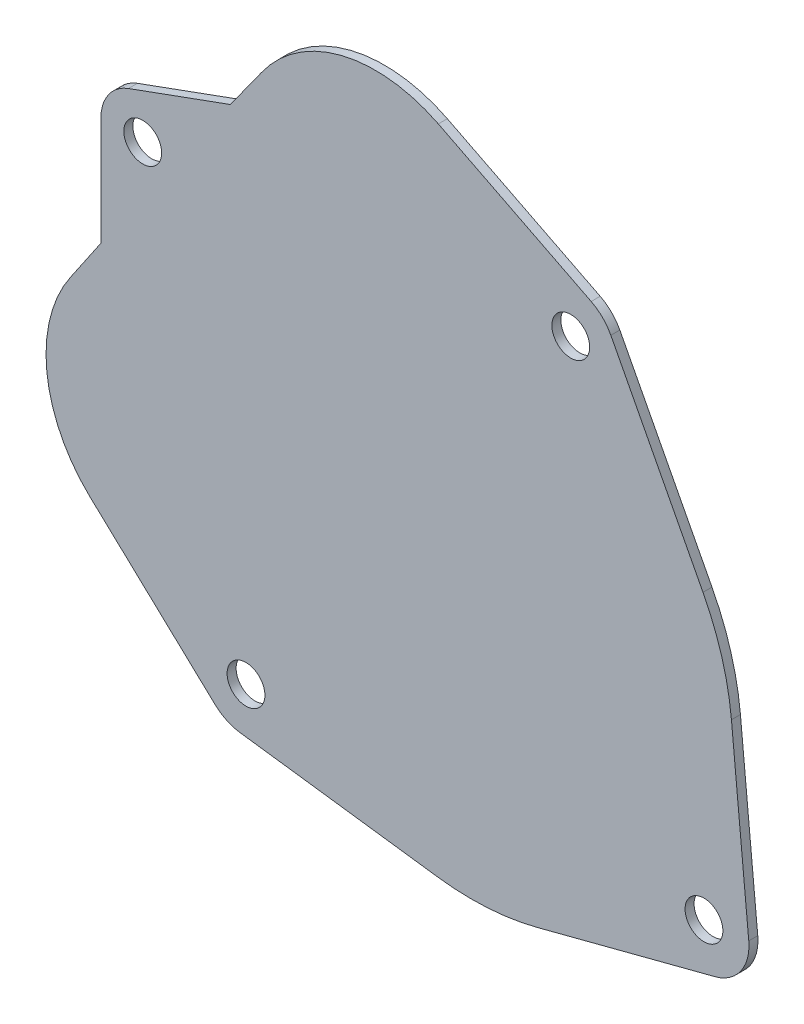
ISO-10303-21;
HEADER;
FILE_DESCRIPTION(('STEP AP214'),'2;1');
FILE_NAME('part.step','',(''),(''),'','','');
FILE_SCHEMA(('AUTOMOTIVE_DESIGN { 1 0 10303 214 1 1 1 1 }'));
ENDSEC;
DATA;
#1=APPLICATION_CONTEXT('core data for automotive mechanical design processes');
#2=APPLICATION_PROTOCOL_DEFINITION('international standard','automotive_design',2000,#1);
#3=PRODUCT_CONTEXT('',#1,'mechanical');
#4=PRODUCT('Part','Part','',(#3));
#5=PRODUCT_RELATED_PRODUCT_CATEGORY('part','',(#4));
#6=PRODUCT_DEFINITION_FORMATION('','',#4);
#7=PRODUCT_DEFINITION_CONTEXT('part definition',#1,'design');
#8=PRODUCT_DEFINITION('design','',#6,#7);
#9=PRODUCT_DEFINITION_SHAPE('','',#8);
#10=(LENGTH_UNIT() NAMED_UNIT(*) SI_UNIT(.MILLI.,.METRE.));
#11=(NAMED_UNIT(*) PLANE_ANGLE_UNIT() SI_UNIT($,.RADIAN.));
#12=(NAMED_UNIT(*) SI_UNIT($,.STERADIAN.) SOLID_ANGLE_UNIT());
#13=UNCERTAINTY_MEASURE_WITH_UNIT(LENGTH_MEASURE(1.E-05),#10,'distance_accuracy_value','');
#14=(GEOMETRIC_REPRESENTATION_CONTEXT(3) GLOBAL_UNCERTAINTY_ASSIGNED_CONTEXT((#13)) GLOBAL_UNIT_ASSIGNED_CONTEXT((#10,
#11,#12)) REPRESENTATION_CONTEXT('',''));
#15=CARTESIAN_POINT('',(0.,0.,0.));
#16=DIRECTION('',(0.,0.,1.));
#17=DIRECTION('',(1.,0.,0.));
#18=AXIS2_PLACEMENT_3D('',#15,#16,#17);
#19=CARTESIAN_POINT('',(-31.7166244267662,17.5170863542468,0.5));
#20=DIRECTION('',(0.,0.,1.));
#21=DIRECTION('',(1.,0.,0.));
#22=AXIS2_PLACEMENT_3D('',#19,#20,#21);
#23=PLANE('',#22);
#24=CARTESIAN_POINT('',(-20.2467719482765,-28.9153870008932,0.5));
#25=DIRECTION('',(0.,0.,1.));
#26=DIRECTION('',(1.,0.,0.));
#27=AXIS2_PLACEMENT_3D('',#24,#25,#26);
#28=CIRCLE('',#27,2.1);
#29=CARTESIAN_POINT('',(-18.1467719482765,-28.9153870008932,0.5));
#30=VERTEX_POINT('',#29);
#31=EDGE_CURVE('E581',#30,#30,#28,.T.);
#32=ORIENTED_EDGE('',*,*,#31,.F.);
#33=EDGE_LOOP('',(#32));
#34=FACE_BOUND('',#33,.T.);
#35=CARTESIAN_POINT('',(15.8385487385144,22.6197918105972,0.5));
#36=DIRECTION('',(0.,0.,1.));
#37=DIRECTION('',(1.,0.,0.));
#38=AXIS2_PLACEMENT_3D('',#35,#36,#37);
#39=CIRCLE('',#38,2.1);
#40=CARTESIAN_POINT('',(17.9385487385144,22.6197918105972,0.5));
#41=VERTEX_POINT('',#40);
#42=EDGE_CURVE('E177',#41,#41,#39,.T.);
#43=ORIENTED_EDGE('',*,*,#42,.F.);
#44=EDGE_LOOP('',(#43));
#45=FACE_BOUND('',#44,.T.);
#46=DIRECTION('',(0.,1.,0.));
#47=VECTOR('',#46,1.);
#48=CARTESIAN_POINT('',(-36.3667741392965,5.46993448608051,0.5));
#49=LINE('',#48,#47);
#50=CARTESIAN_POINT('',(-36.3667741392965,5.46993448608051,0.5));
#51=VERTEX_POINT('',#50);
#52=CARTESIAN_POINT('',(-36.3667741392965,17.5170863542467,0.5));
#53=VERTEX_POINT('',#52);
#54=EDGE_CURVE('E160',#51,#53,#49,.T.);
#55=ORIENTED_EDGE('',*,*,#54,.F.);
#56=DIRECTION('',(0.56326527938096,0.826276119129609,0.));
#57=VECTOR('',#56,1.);
#58=CARTESIAN_POINT('',(-39.6617252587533,0.636440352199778,0.5));
#59=LINE('',#58,#57);
#60=CARTESIAN_POINT('',(-39.6617252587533,0.636440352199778,0.5));
#61=VERTEX_POINT('',#60);
#62=EDGE_CURVE('E166',#61,#51,#59,.T.);
#63=ORIENTED_EDGE('',*,*,#62,.F.);
#64=CARTESIAN_POINT('',(-26.9631728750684,-8.25157221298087,0.5));
#65=DIRECTION('',(0.,0.,1.));
#66=DIRECTION('',(1.,0.,0.));
#67=AXIS2_PLACEMENT_3D('',#64,#65,#66);
#68=CIRCLE('',#67,15.5);
#69=CARTESIAN_POINT('',(-37.5666044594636,-19.5572008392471,0.5));
#70=VERTEX_POINT('',#69);
#71=EDGE_CURVE('E273',#61,#70,#68,.T.);
#72=ORIENTED_EDGE('',*,*,#71,.T.);
#73=DIRECTION('',(0.72939539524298,-0.684092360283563,0.));
#74=VECTOR('',#73,1.);
#75=CARTESIAN_POINT('',(-37.5666044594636,-19.5572008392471,0.5));
#76=LINE('',#75,#74);
#77=CARTESIAN_POINT('',(-23.6826581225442,-32.5788098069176,0.5));
#78=VERTEX_POINT('',#77);
#79=EDGE_CURVE('E270',#70,#78,#76,.T.);
#80=ORIENTED_EDGE('',*,*,#79,.T.);
#81=CARTESIAN_POINT('',(-20.2467719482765,-28.9153870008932,0.5));
#82=DIRECTION('',(0.,0.,-1.));
#83=DIRECTION('',(-1.,0.,0.));
#84=AXIS2_PLACEMENT_3D('',#81,#82,#83);
#85=CIRCLE('',#84,5.02254720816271);
#86=CARTESIAN_POINT('',(-20.907521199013,-33.8942815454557,0.5));
#87=VERTEX_POINT('',#86);
#88=EDGE_CURVE('E267',#87,#78,#85,.T.);
#89=ORIENTED_EDGE('',*,*,#88,.F.);
#90=DIRECTION('',(0.991308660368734,-0.13155660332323,0.));
#91=VECTOR('',#90,1.);
#92=CARTESIAN_POINT('',(-20.907521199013,-33.8942815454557,0.5));
#93=LINE('',#92,#91);
#94=CARTESIAN_POINT('',(1.02816442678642,-36.8053670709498,0.5));
#95=VERTEX_POINT('',#94);
#96=EDGE_CURVE('E264',#87,#95,#93,.T.);
#97=ORIENTED_EDGE('',*,*,#96,.T.);
#98=CARTESIAN_POINT('',(4.84330592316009,-8.05741592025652,0.5));
#99=DIRECTION('',(0.,0.,1.));
#100=DIRECTION('',(1.,0.,0.));
#101=AXIS2_PLACEMENT_3D('',#98,#99,#100);
#102=CIRCLE('',#101,29.);
#103=CARTESIAN_POINT('',(12.1473504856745,-36.1225354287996,0.5));
#104=VERTEX_POINT('',#103);
#105=EDGE_CURVE('E261',#95,#104,#102,.T.);
#106=ORIENTED_EDGE('',*,*,#105,.T.);
#107=DIRECTION('',(-0.967762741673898,-0.251863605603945,0.));
#108=VECTOR('',#107,1.);
#109=CARTESIAN_POINT('',(31.8969354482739,-30.9826375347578,0.5));
#110=LINE('',#109,#108);
#111=CARTESIAN_POINT('',(31.8969354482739,-30.9826375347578,0.5));
#112=VERTEX_POINT('',#111);
#113=EDGE_CURVE('E258',#112,#104,#110,.T.);
#114=ORIENTED_EDGE('',*,*,#113,.F.);
#115=CARTESIAN_POINT('',(30.6376174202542,-26.1438238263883,0.5));
#116=DIRECTION('',(0.,0.,-1.));
#117=DIRECTION('',(-1.,0.,0.));
#118=AXIS2_PLACEMENT_3D('',#115,#116,#117);
#119=CIRCLE('',#118,4.99999999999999);
#120=CARTESIAN_POINT('',(35.6153270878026,-25.6722239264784,0.5));
#121=VERTEX_POINT('',#120);
#122=EDGE_CURVE('E255',#121,#112,#119,.T.);
#123=ORIENTED_EDGE('',*,*,#122,.F.);
#124=DIRECTION('',(-0.0943199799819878,0.995541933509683,0.));
#125=VECTOR('',#124,1.);
#126=CARTESIAN_POINT('',(35.6153270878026,-25.6722239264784,0.5));
#127=LINE('',#126,#125);
#128=CARTESIAN_POINT('',(33.690495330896,-5.35573605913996,0.5));
#129=VERTEX_POINT('',#128);
#130=EDGE_CURVE('E252',#121,#129,#127,.T.);
#131=ORIENTED_EDGE('',*,*,#130,.T.);
#132=CARTESIAN_POINT('',(4.81977925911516,-8.09101547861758,0.5));
#133=DIRECTION('',(0.,0.,-1.));
#134=DIRECTION('',(-1.,0.,0.));
#135=AXIS2_PLACEMENT_3D('',#132,#133,#134);
#136=CIRCLE('',#135,29.);
#137=CARTESIAN_POINT('',(30.529161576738,5.32642320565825,0.5));
#138=VERTEX_POINT('',#137);
#139=EDGE_CURVE('E249',#138,#129,#136,.T.);
#140=ORIENTED_EDGE('',*,*,#139,.F.);
#141=DIRECTION('',(0.462670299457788,-0.886530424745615,0.));
#142=VECTOR('',#141,1.);
#143=CARTESIAN_POINT('',(20.2911896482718,24.9435752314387,0.5));
#144=LINE('',#143,#142);
#145=CARTESIAN_POINT('',(20.2911896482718,24.9435752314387,0.5));
#146=VERTEX_POINT('',#145);
#147=EDGE_CURVE('E246',#146,#138,#144,.T.);
#148=ORIENTED_EDGE('',*,*,#147,.F.);
#149=CARTESIAN_POINT('',(15.8385487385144,22.6197918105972,0.5));
#150=DIRECTION('',(0.,0.,1.));
#151=DIRECTION('',(1.,0.,0.));
#152=AXIS2_PLACEMENT_3D('',#149,#150,#151);
#153=CIRCLE('',#152,5.02254720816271);
#154=CARTESIAN_POINT('',(18.1058978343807,27.1014330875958,0.5));
#155=VERTEX_POINT('',#154);
#156=EDGE_CURVE('E243',#146,#155,#153,.T.);
#157=ORIENTED_EDGE('',*,*,#156,.T.);
#158=DIRECTION('',(0.892304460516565,-0.451434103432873,0.));
#159=VECTOR('',#158,1.);
#160=CARTESIAN_POINT('',(1.12099866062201,35.6944224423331,0.5));
#161=LINE('',#160,#159);
#162=CARTESIAN_POINT('',(1.12099866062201,35.6944224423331,0.5));
#163=VERTEX_POINT('',#162);
#164=EDGE_CURVE('E240',#163,#155,#161,.T.);
#165=ORIENTED_EDGE('',*,*,#164,.F.);
#166=CARTESIAN_POINT('',(-5.87622994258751,21.8637033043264,0.5));
#167=DIRECTION('',(0.,0.,-1.));
#168=DIRECTION('',(-1.,0.,0.));
#169=AXIS2_PLACEMENT_3D('',#166,#167,#168);
#170=CIRCLE('',#169,15.5);
#171=CARTESIAN_POINT('',(-18.5713904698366,30.756559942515,0.5));
#172=VERTEX_POINT('',#171);
#173=EDGE_CURVE('E237',#172,#163,#170,.T.);
#174=ORIENTED_EDGE('',*,*,#173,.F.);
#175=DIRECTION('',(-0.583797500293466,-0.811899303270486,0.));
#176=VECTOR('',#175,1.);
#177=CARTESIAN_POINT('',(-18.5713904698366,30.756559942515,0.5));
#178=LINE('',#177,#176);
#179=CARTESIAN_POINT('',(-21.9864495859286,26.0071663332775,0.5));
#180=VERTEX_POINT('',#179);
#181=EDGE_CURVE('E234',#172,#180,#178,.T.);
#182=ORIENTED_EDGE('',*,*,#181,.T.);
#183=DIRECTION('',(-0.939692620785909,-0.342020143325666,0.));
#184=VECTOR('',#183,1.);
#185=CARTESIAN_POINT('',(-21.9864495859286,26.0071663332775,0.5));
#186=LINE('',#185,#184);
#187=CARTESIAN_POINT('',(-33.3070692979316,21.8867977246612,0.5));
#188=VERTEX_POINT('',#187);
#189=EDGE_CURVE('E231',#180,#188,#186,.T.);
#190=ORIENTED_EDGE('',*,*,#189,.T.);
#191=CARTESIAN_POINT('',(-31.7166244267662,17.5170863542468,0.5));
#192=DIRECTION('',(0.,0.,1.));
#193=DIRECTION('',(1.,0.,0.));
#194=AXIS2_PLACEMENT_3D('',#191,#192,#193);
#195=CIRCLE('',#194,4.65014971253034);
#196=EDGE_CURVE('E229',#188,#53,#195,.T.);
#197=ORIENTED_EDGE('',*,*,#196,.T.);
#198=EDGE_LOOP('',(#55,#63,#72,#80,#89,#97,#106,#114,#123,#131,#140,#148,#157,#165,#174,#182,
#190,#197));
#199=FACE_BOUND('',#198,.T.);
#200=CARTESIAN_POINT('',(-31.7166244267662,17.5170863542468,0.5));
#201=DIRECTION('',(0.,0.,1.));
#202=DIRECTION('',(1.,0.,0.));
#203=AXIS2_PLACEMENT_3D('',#200,#201,#202);
#204=CIRCLE('',#203,2.1);
#205=CARTESIAN_POINT('',(-29.6166244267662,17.5170863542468,0.5));
#206=VERTEX_POINT('',#205);
#207=EDGE_CURVE('E587',#206,#206,#204,.T.);
#208=ORIENTED_EDGE('',*,*,#207,.F.);
#209=EDGE_LOOP('',(#208));
#210=FACE_BOUND('',#209,.T.);
#211=CARTESIAN_POINT('',(30.6376174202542,-26.1438238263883,0.5));
#212=DIRECTION('',(0.,0.,1.));
#213=DIRECTION('',(1.,0.,0.));
#214=AXIS2_PLACEMENT_3D('',#211,#212,#213);
#215=CIRCLE('',#214,2.1);
#216=CARTESIAN_POINT('',(32.7376174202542,-26.1438238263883,0.5));
#217=VERTEX_POINT('',#216);
#218=EDGE_CURVE('E570',#217,#217,#215,.T.);
#219=ORIENTED_EDGE('',*,*,#218,.F.);
#220=EDGE_LOOP('',(#219));
#221=FACE_BOUND('',#220,.T.);
#222=ADVANCED_FACE('F34',(#34,#45,#199,#210,#221),#23,.T.);
#223=CARTESIAN_POINT('',(-31.7166244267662,17.5170863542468,-0.5));
#224=DIRECTION('',(0.,0.,1.));
#225=DIRECTION('',(1.,0.,0.));
#226=AXIS2_PLACEMENT_3D('',#223,#224,#225);
#227=PLANE('',#226);
#228=CARTESIAN_POINT('',(-20.2467719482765,-28.9153870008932,-0.5));
#229=DIRECTION('',(0.,0.,1.));
#230=DIRECTION('',(1.,0.,0.));
#231=AXIS2_PLACEMENT_3D('',#228,#229,#230);
#232=CIRCLE('',#231,2.1);
#233=CARTESIAN_POINT('',(-18.1467719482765,-28.9153870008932,-0.5));
#234=VERTEX_POINT('',#233);
#235=EDGE_CURVE('E576',#234,#234,#232,.T.);
#236=ORIENTED_EDGE('',*,*,#235,.T.);
#237=EDGE_LOOP('',(#236));
#238=FACE_BOUND('',#237,.T.);
#239=CARTESIAN_POINT('',(15.8385487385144,22.6197918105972,-0.5));
#240=DIRECTION('',(0.,0.,1.));
#241=DIRECTION('',(1.,0.,0.));
#242=AXIS2_PLACEMENT_3D('',#239,#240,#241);
#243=CIRCLE('',#242,2.1);
#244=CARTESIAN_POINT('',(17.9385487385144,22.6197918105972,-0.5));
#245=VERTEX_POINT('',#244);
#246=EDGE_CURVE('E590',#245,#245,#243,.T.);
#247=ORIENTED_EDGE('',*,*,#246,.T.);
#248=EDGE_LOOP('',(#247));
#249=FACE_BOUND('',#248,.T.);
#250=DIRECTION('',(0.,1.,0.));
#251=VECTOR('',#250,1.);
#252=CARTESIAN_POINT('',(-36.3667741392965,5.46993448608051,-0.5));
#253=LINE('',#252,#251);
#254=CARTESIAN_POINT('',(-36.3667741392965,5.46993448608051,-0.5));
#255=VERTEX_POINT('',#254);
#256=CARTESIAN_POINT('',(-36.3667741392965,17.5170863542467,-0.5));
#257=VERTEX_POINT('',#256);
#258=EDGE_CURVE('E158',#255,#257,#253,.T.);
#259=ORIENTED_EDGE('',*,*,#258,.T.);
#260=CARTESIAN_POINT('',(-31.7166244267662,17.5170863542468,-0.5));
#261=DIRECTION('',(0.,0.,1.));
#262=DIRECTION('',(1.,0.,0.));
#263=AXIS2_PLACEMENT_3D('',#260,#261,#262);
#264=CIRCLE('',#263,4.65014971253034);
#265=CARTESIAN_POINT('',(-33.3070692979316,21.8867977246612,-0.5));
#266=VERTEX_POINT('',#265);
#267=EDGE_CURVE('E173',#266,#257,#264,.T.);
#268=ORIENTED_EDGE('',*,*,#267,.F.);
#269=DIRECTION('',(-0.939692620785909,-0.342020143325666,0.));
#270=VECTOR('',#269,1.);
#271=CARTESIAN_POINT('',(-21.9864495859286,26.0071663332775,-0.5));
#272=LINE('',#271,#270);
#273=CARTESIAN_POINT('',(-21.9864495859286,26.0071663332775,-0.5));
#274=VERTEX_POINT('',#273);
#275=EDGE_CURVE('E180',#274,#266,#272,.T.);
#276=ORIENTED_EDGE('',*,*,#275,.F.);
#277=DIRECTION('',(-0.583797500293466,-0.811899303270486,0.));
#278=VECTOR('',#277,1.);
#279=CARTESIAN_POINT('',(-18.5713904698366,30.756559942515,-0.5));
#280=LINE('',#279,#278);
#281=CARTESIAN_POINT('',(-18.5713904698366,30.756559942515,-0.5));
#282=VERTEX_POINT('',#281);
#283=EDGE_CURVE('E182',#282,#274,#280,.T.);
#284=ORIENTED_EDGE('',*,*,#283,.F.);
#285=CARTESIAN_POINT('',(-5.87622994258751,21.8637033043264,-0.5));
#286=DIRECTION('',(0.,0.,-1.));
#287=DIRECTION('',(-1.,0.,0.));
#288=AXIS2_PLACEMENT_3D('',#285,#286,#287);
#289=CIRCLE('',#288,15.5);
#290=CARTESIAN_POINT('',(1.12099866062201,35.6944224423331,-0.5));
#291=VERTEX_POINT('',#290);
#292=EDGE_CURVE('E188',#282,#291,#289,.T.);
#293=ORIENTED_EDGE('',*,*,#292,.T.);
#294=DIRECTION('',(0.892304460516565,-0.451434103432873,0.));
#295=VECTOR('',#294,1.);
#296=CARTESIAN_POINT('',(1.12099866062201,35.6944224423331,-0.5));
#297=LINE('',#296,#295);
#298=CARTESIAN_POINT('',(18.1058978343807,27.1014330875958,-0.5));
#299=VERTEX_POINT('',#298);
#300=EDGE_CURVE('E191',#291,#299,#297,.T.);
#301=ORIENTED_EDGE('',*,*,#300,.T.);
#302=CARTESIAN_POINT('',(15.8385487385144,22.6197918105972,-0.5));
#303=DIRECTION('',(0.,0.,1.));
#304=DIRECTION('',(1.,0.,0.));
#305=AXIS2_PLACEMENT_3D('',#302,#303,#304);
#306=CIRCLE('',#305,5.02254720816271);
#307=CARTESIAN_POINT('',(20.2911896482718,24.9435752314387,-0.5));
#308=VERTEX_POINT('',#307);
#309=EDGE_CURVE('E194',#308,#299,#306,.T.);
#310=ORIENTED_EDGE('',*,*,#309,.F.);
#311=DIRECTION('',(0.462670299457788,-0.886530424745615,0.));
#312=VECTOR('',#311,1.);
#313=CARTESIAN_POINT('',(20.2911896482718,24.9435752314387,-0.5));
#314=LINE('',#313,#312);
#315=CARTESIAN_POINT('',(30.529161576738,5.32642320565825,-0.5));
#316=VERTEX_POINT('',#315);
#317=EDGE_CURVE('E197',#308,#316,#314,.T.);
#318=ORIENTED_EDGE('',*,*,#317,.T.);
#319=CARTESIAN_POINT('',(4.81977925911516,-8.09101547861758,-0.5));
#320=DIRECTION('',(0.,0.,-1.));
#321=DIRECTION('',(-1.,0.,0.));
#322=AXIS2_PLACEMENT_3D('',#319,#320,#321);
#323=CIRCLE('',#322,29.);
#324=CARTESIAN_POINT('',(33.690495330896,-5.35573605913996,-0.5));
#325=VERTEX_POINT('',#324);
#326=EDGE_CURVE('E200',#316,#325,#323,.T.);
#327=ORIENTED_EDGE('',*,*,#326,.T.);
#328=DIRECTION('',(-0.0943199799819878,0.995541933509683,0.));
#329=VECTOR('',#328,1.);
#330=CARTESIAN_POINT('',(35.6153270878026,-25.6722239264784,-0.5));
#331=LINE('',#330,#329);
#332=CARTESIAN_POINT('',(35.6153270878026,-25.6722239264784,-0.5));
#333=VERTEX_POINT('',#332);
#334=EDGE_CURVE('E203',#333,#325,#331,.T.);
#335=ORIENTED_EDGE('',*,*,#334,.F.);
#336=CARTESIAN_POINT('',(30.6376174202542,-26.1438238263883,-0.5));
#337=DIRECTION('',(0.,0.,-1.));
#338=DIRECTION('',(-1.,0.,0.));
#339=AXIS2_PLACEMENT_3D('',#336,#337,#338);
#340=CIRCLE('',#339,4.99999999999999);
#341=CARTESIAN_POINT('',(31.8969354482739,-30.9826375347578,-0.5));
#342=VERTEX_POINT('',#341);
#343=EDGE_CURVE('E206',#333,#342,#340,.T.);
#344=ORIENTED_EDGE('',*,*,#343,.T.);
#345=DIRECTION('',(-0.967762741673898,-0.251863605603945,0.));
#346=VECTOR('',#345,1.);
#347=CARTESIAN_POINT('',(31.8969354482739,-30.9826375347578,-0.5));
#348=LINE('',#347,#346);
#349=CARTESIAN_POINT('',(12.1473504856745,-36.1225354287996,-0.5));
#350=VERTEX_POINT('',#349);
#351=EDGE_CURVE('E209',#342,#350,#348,.T.);
#352=ORIENTED_EDGE('',*,*,#351,.T.);
#353=CARTESIAN_POINT('',(4.84330592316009,-8.05741592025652,-0.5));
#354=DIRECTION('',(0.,0.,1.));
#355=DIRECTION('',(1.,0.,0.));
#356=AXIS2_PLACEMENT_3D('',#353,#354,#355);
#357=CIRCLE('',#356,29.);
#358=CARTESIAN_POINT('',(1.02816442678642,-36.8053670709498,-0.5));
#359=VERTEX_POINT('',#358);
#360=EDGE_CURVE('E212',#359,#350,#357,.T.);
#361=ORIENTED_EDGE('',*,*,#360,.F.);
#362=DIRECTION('',(0.991308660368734,-0.13155660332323,0.));
#363=VECTOR('',#362,1.);
#364=CARTESIAN_POINT('',(-20.907521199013,-33.8942815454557,-0.5));
#365=LINE('',#364,#363);
#366=CARTESIAN_POINT('',(-20.907521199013,-33.8942815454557,-0.5));
#367=VERTEX_POINT('',#366);
#368=EDGE_CURVE('E215',#367,#359,#365,.T.);
#369=ORIENTED_EDGE('',*,*,#368,.F.);
#370=CARTESIAN_POINT('',(-20.2467719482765,-28.9153870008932,-0.5));
#371=DIRECTION('',(0.,0.,-1.));
#372=DIRECTION('',(-1.,0.,0.));
#373=AXIS2_PLACEMENT_3D('',#370,#371,#372);
#374=CIRCLE('',#373,5.02254720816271);
#375=CARTESIAN_POINT('',(-23.6826581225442,-32.5788098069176,-0.5));
#376=VERTEX_POINT('',#375);
#377=EDGE_CURVE('E218',#367,#376,#374,.T.);
#378=ORIENTED_EDGE('',*,*,#377,.T.);
#379=DIRECTION('',(0.72939539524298,-0.684092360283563,0.));
#380=VECTOR('',#379,1.);
#381=CARTESIAN_POINT('',(-37.5666044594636,-19.5572008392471,-0.5));
#382=LINE('',#381,#380);
#383=CARTESIAN_POINT('',(-37.5666044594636,-19.5572008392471,-0.5));
#384=VERTEX_POINT('',#383);
#385=EDGE_CURVE('E221',#384,#376,#382,.T.);
#386=ORIENTED_EDGE('',*,*,#385,.F.);
#387=CARTESIAN_POINT('',(-26.9631728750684,-8.25157221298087,-0.5));
#388=DIRECTION('',(0.,0.,1.));
#389=DIRECTION('',(1.,0.,0.));
#390=AXIS2_PLACEMENT_3D('',#387,#388,#389);
#391=CIRCLE('',#390,15.5);
#392=CARTESIAN_POINT('',(-39.6617252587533,0.636440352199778,-0.5));
#393=VERTEX_POINT('',#392);
#394=EDGE_CURVE('E224',#393,#384,#391,.T.);
#395=ORIENTED_EDGE('',*,*,#394,.F.);
#396=DIRECTION('',(0.56326527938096,0.826276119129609,0.));
#397=VECTOR('',#396,1.);
#398=CARTESIAN_POINT('',(-39.6617252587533,0.636440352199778,-0.5));
#399=LINE('',#398,#397);
#400=EDGE_CURVE('E176',#393,#255,#399,.T.);
#401=ORIENTED_EDGE('',*,*,#400,.T.);
#402=EDGE_LOOP('',(#259,#268,#276,#284,#293,#301,#310,#318,#327,#335,#344,#352,#361,#369,#378,
#386,#395,#401));
#403=FACE_BOUND('',#402,.T.);
#404=CARTESIAN_POINT('',(-31.7166244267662,17.5170863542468,-0.5));
#405=DIRECTION('',(0.,0.,1.));
#406=DIRECTION('',(1.,0.,0.));
#407=AXIS2_PLACEMENT_3D('',#404,#405,#406);
#408=CIRCLE('',#407,2.1);
#409=CARTESIAN_POINT('',(-29.6166244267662,17.5170863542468,-0.5));
#410=VERTEX_POINT('',#409);
#411=EDGE_CURVE('E584',#410,#410,#408,.T.);
#412=ORIENTED_EDGE('',*,*,#411,.T.);
#413=EDGE_LOOP('',(#412));
#414=FACE_BOUND('',#413,.T.);
#415=CARTESIAN_POINT('',(30.6376174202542,-26.1438238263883,-0.5));
#416=DIRECTION('',(0.,0.,1.));
#417=DIRECTION('',(1.,0.,0.));
#418=AXIS2_PLACEMENT_3D('',#415,#416,#417);
#419=CIRCLE('',#418,2.1);
#420=CARTESIAN_POINT('',(32.7376174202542,-26.1438238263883,-0.5));
#421=VERTEX_POINT('',#420);
#422=EDGE_CURVE('E573',#421,#421,#419,.T.);
#423=ORIENTED_EDGE('',*,*,#422,.T.);
#424=EDGE_LOOP('',(#423));
#425=FACE_BOUND('',#424,.T.);
#426=ADVANCED_FACE('F170',(#238,#249,#403,#414,#425),#227,.F.);
#427=CARTESIAN_POINT('',(-36.3667741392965,5.46993448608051,0.5));
#428=DIRECTION('',(-1.,0.,0.));
#429=DIRECTION('',(0.,-1.,0.));
#430=AXIS2_PLACEMENT_3D('',#427,#428,#429);
#431=PLANE('',#430);
#432=DIRECTION('',(0.,0.,-1.));
#433=VECTOR('',#432,1.);
#434=CARTESIAN_POINT('',(-36.3667741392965,5.46993448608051,0.5));
#435=LINE('',#434,#433);
#436=EDGE_CURVE('E11',#51,#255,#435,.T.);
#437=ORIENTED_EDGE('',*,*,#436,.F.);
#438=ORIENTED_EDGE('',*,*,#54,.T.);
#439=DIRECTION('',(0.,0.,-1.));
#440=VECTOR('',#439,1.);
#441=CARTESIAN_POINT('',(-36.3667741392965,17.5170863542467,0.5));
#442=LINE('',#441,#440);
#443=EDGE_CURVE('E155',#53,#257,#442,.T.);
#444=ORIENTED_EDGE('',*,*,#443,.T.);
#445=ORIENTED_EDGE('',*,*,#258,.F.);
#446=EDGE_LOOP('',(#437,#438,#444,#445));
#447=FACE_BOUND('',#446,.T.);
#448=ADVANCED_FACE('F157',(#447),#431,.T.);
#449=CARTESIAN_POINT('',(-39.6617252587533,0.636440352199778,0.5));
#450=DIRECTION('',(-0.826276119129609,0.56326527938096,0.));
#451=DIRECTION('',(-0.56326527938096,-0.82627611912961,0.));
#452=AXIS2_PLACEMENT_3D('',#449,#450,#451);
#453=PLANE('',#452);
#454=DIRECTION('',(0.,0.,-1.));
#455=VECTOR('',#454,1.);
#456=CARTESIAN_POINT('',(-39.6617252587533,0.636440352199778,0.5));
#457=LINE('',#456,#455);
#458=EDGE_CURVE('E42',#61,#393,#457,.T.);
#459=ORIENTED_EDGE('',*,*,#458,.F.);
#460=ORIENTED_EDGE('',*,*,#62,.T.);
#461=ORIENTED_EDGE('',*,*,#436,.T.);
#462=ORIENTED_EDGE('',*,*,#400,.F.);
#463=EDGE_LOOP('',(#459,#460,#461,#462));
#464=FACE_BOUND('',#463,.T.);
#465=ADVANCED_FACE('F36',(#464),#453,.T.);
#466=CARTESIAN_POINT('',(-26.9631728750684,-8.25157221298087,0.5));
#467=DIRECTION('',(0.,0.,-1.));
#468=DIRECTION('',(-1.,0.,0.));
#469=AXIS2_PLACEMENT_3D('',#466,#467,#468);
#470=CYLINDRICAL_SURFACE('',#469,15.5);
#471=DIRECTION('',(0.,0.,-1.));
#472=VECTOR('',#471,1.);
#473=CARTESIAN_POINT('',(-37.5666044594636,-19.5572008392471,0.5));
#474=LINE('',#473,#472);
#475=EDGE_CURVE('E304',#70,#384,#474,.T.);
#476=ORIENTED_EDGE('',*,*,#475,.F.);
#477=ORIENTED_EDGE('',*,*,#71,.F.);
#478=ORIENTED_EDGE('',*,*,#458,.T.);
#479=ORIENTED_EDGE('',*,*,#394,.T.);
#480=EDGE_LOOP('',(#476,#477,#478,#479));
#481=FACE_BOUND('',#480,.T.);
#482=ADVANCED_FACE('F306',(#481),#470,.T.);
#483=CARTESIAN_POINT('',(-37.5666044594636,-19.5572008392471,0.5));
#484=DIRECTION('',(0.684092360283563,0.72939539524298,0.));
#485=DIRECTION('',(-0.72939539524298,0.684092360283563,0.));
#486=AXIS2_PLACEMENT_3D('',#483,#484,#485);
#487=PLANE('',#486);
#488=DIRECTION('',(0.,0.,-1.));
#489=VECTOR('',#488,1.);
#490=CARTESIAN_POINT('',(-23.6826581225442,-32.5788098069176,0.5));
#491=LINE('',#490,#489);
#492=EDGE_CURVE('E302',#78,#376,#491,.T.);
#493=ORIENTED_EDGE('',*,*,#492,.F.);
#494=ORIENTED_EDGE('',*,*,#79,.F.);
#495=ORIENTED_EDGE('',*,*,#475,.T.);
#496=ORIENTED_EDGE('',*,*,#385,.T.);
#497=EDGE_LOOP('',(#493,#494,#495,#496));
#498=FACE_BOUND('',#497,.T.);
#499=ADVANCED_FACE('F363',(#498),#487,.F.);
#500=CARTESIAN_POINT('',(-20.2467719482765,-28.9153870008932,0.5));
#501=DIRECTION('',(0.,0.,-1.));
#502=DIRECTION('',(-1.,0.,0.));
#503=AXIS2_PLACEMENT_3D('',#500,#501,#502);
#504=CYLINDRICAL_SURFACE('',#503,5.02254720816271);
#505=DIRECTION('',(0.,0.,-1.));
#506=VECTOR('',#505,1.);
#507=CARTESIAN_POINT('',(-20.907521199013,-33.8942815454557,0.5));
#508=LINE('',#507,#506);
#509=EDGE_CURVE('E300',#87,#367,#508,.T.);
#510=ORIENTED_EDGE('',*,*,#509,.F.);
#511=ORIENTED_EDGE('',*,*,#88,.T.);
#512=ORIENTED_EDGE('',*,*,#492,.T.);
#513=ORIENTED_EDGE('',*,*,#377,.F.);
#514=EDGE_LOOP('',(#510,#511,#512,#513));
#515=FACE_BOUND('',#514,.T.);
#516=ADVANCED_FACE('F361',(#515),#504,.T.);
#517=CARTESIAN_POINT('',(-20.907521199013,-33.8942815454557,0.5));
#518=DIRECTION('',(0.13155660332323,0.991308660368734,0.));
#519=DIRECTION('',(-0.991308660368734,0.13155660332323,0.));
#520=AXIS2_PLACEMENT_3D('',#517,#518,#519);
#521=PLANE('',#520);
#522=DIRECTION('',(0.,0.,-1.));
#523=VECTOR('',#522,1.);
#524=CARTESIAN_POINT('',(1.02816442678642,-36.8053670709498,0.5));
#525=LINE('',#524,#523);
#526=EDGE_CURVE('E298',#95,#359,#525,.T.);
#527=ORIENTED_EDGE('',*,*,#526,.F.);
#528=ORIENTED_EDGE('',*,*,#96,.F.);
#529=ORIENTED_EDGE('',*,*,#509,.T.);
#530=ORIENTED_EDGE('',*,*,#368,.T.);
#531=EDGE_LOOP('',(#527,#528,#529,#530));
#532=FACE_BOUND('',#531,.T.);
#533=ADVANCED_FACE('F357',(#532),#521,.F.);
#534=CARTESIAN_POINT('',(4.84330592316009,-8.05741592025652,0.5));
#535=DIRECTION('',(0.,0.,-1.));
#536=DIRECTION('',(-1.,0.,0.));
#537=AXIS2_PLACEMENT_3D('',#534,#535,#536);
#538=CYLINDRICAL_SURFACE('',#537,29.);
#539=DIRECTION('',(0.,0.,-1.));
#540=VECTOR('',#539,1.);
#541=CARTESIAN_POINT('',(12.1473504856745,-36.1225354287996,0.5));
#542=LINE('',#541,#540);
#543=EDGE_CURVE('E296',#104,#350,#542,.T.);
#544=ORIENTED_EDGE('',*,*,#543,.F.);
#545=ORIENTED_EDGE('',*,*,#105,.F.);
#546=ORIENTED_EDGE('',*,*,#526,.T.);
#547=ORIENTED_EDGE('',*,*,#360,.T.);
#548=EDGE_LOOP('',(#544,#545,#546,#547));
#549=FACE_BOUND('',#548,.T.);
#550=ADVANCED_FACE('F353',(#549),#538,.T.);
#551=CARTESIAN_POINT('',(31.8969354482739,-30.9826375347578,0.5));
#552=DIRECTION('',(0.251863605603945,-0.967762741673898,0.));
#553=DIRECTION('',(0.967762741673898,0.251863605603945,0.));
#554=AXIS2_PLACEMENT_3D('',#551,#552,#553);
#555=PLANE('',#554);
#556=DIRECTION('',(0.,0.,-1.));
#557=VECTOR('',#556,1.);
#558=CARTESIAN_POINT('',(31.8969354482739,-30.9826375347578,0.5));
#559=LINE('',#558,#557);
#560=EDGE_CURVE('E294',#112,#342,#559,.T.);
#561=ORIENTED_EDGE('',*,*,#560,.F.);
#562=ORIENTED_EDGE('',*,*,#113,.T.);
#563=ORIENTED_EDGE('',*,*,#543,.T.);
#564=ORIENTED_EDGE('',*,*,#351,.F.);
#565=EDGE_LOOP('',(#561,#562,#563,#564));
#566=FACE_BOUND('',#565,.T.);
#567=ADVANCED_FACE('F350',(#566),#555,.T.);
#568=CARTESIAN_POINT('',(30.6376174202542,-26.1438238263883,0.5));
#569=DIRECTION('',(0.,0.,-1.));
#570=DIRECTION('',(-1.,0.,0.));
#571=AXIS2_PLACEMENT_3D('',#568,#569,#570);
#572=CYLINDRICAL_SURFACE('',#571,4.99999999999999);
#573=DIRECTION('',(0.,0.,-1.));
#574=VECTOR('',#573,1.);
#575=CARTESIAN_POINT('',(35.6153270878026,-25.6722239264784,0.5));
#576=LINE('',#575,#574);
#577=EDGE_CURVE('E292',#121,#333,#576,.T.);
#578=ORIENTED_EDGE('',*,*,#577,.F.);
#579=ORIENTED_EDGE('',*,*,#122,.T.);
#580=ORIENTED_EDGE('',*,*,#560,.T.);
#581=ORIENTED_EDGE('',*,*,#343,.F.);
#582=EDGE_LOOP('',(#578,#579,#580,#581));
#583=FACE_BOUND('',#582,.T.);
#584=ADVANCED_FACE('F345',(#583),#572,.T.);
#585=CARTESIAN_POINT('',(35.6153270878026,-25.6722239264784,0.5));
#586=DIRECTION('',(-0.995541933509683,-0.0943199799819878,0.));
#587=DIRECTION('',(0.0943199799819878,-0.995541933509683,0.));
#588=AXIS2_PLACEMENT_3D('',#585,#586,#587);
#589=PLANE('',#588);
#590=DIRECTION('',(0.,0.,-1.));
#591=VECTOR('',#590,1.);
#592=CARTESIAN_POINT('',(33.690495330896,-5.35573605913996,0.5));
#593=LINE('',#592,#591);
#594=EDGE_CURVE('E290',#129,#325,#593,.T.);
#595=ORIENTED_EDGE('',*,*,#594,.F.);
#596=ORIENTED_EDGE('',*,*,#130,.F.);
#597=ORIENTED_EDGE('',*,*,#577,.T.);
#598=ORIENTED_EDGE('',*,*,#334,.T.);
#599=EDGE_LOOP('',(#595,#596,#597,#598));
#600=FACE_BOUND('',#599,.T.);
#601=ADVANCED_FACE('F341',(#600),#589,.F.);
#602=CARTESIAN_POINT('',(4.81977925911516,-8.09101547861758,0.5));
#603=DIRECTION('',(0.,0.,-1.));
#604=DIRECTION('',(-1.,0.,0.));
#605=AXIS2_PLACEMENT_3D('',#602,#603,#604);
#606=CYLINDRICAL_SURFACE('',#605,29.);
#607=DIRECTION('',(0.,0.,-1.));
#608=VECTOR('',#607,1.);
#609=CARTESIAN_POINT('',(30.529161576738,5.32642320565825,0.5));
#610=LINE('',#609,#608);
#611=EDGE_CURVE('E288',#138,#316,#610,.T.);
#612=ORIENTED_EDGE('',*,*,#611,.F.);
#613=ORIENTED_EDGE('',*,*,#139,.T.);
#614=ORIENTED_EDGE('',*,*,#594,.T.);
#615=ORIENTED_EDGE('',*,*,#326,.F.);
#616=EDGE_LOOP('',(#612,#613,#614,#615));
#617=FACE_BOUND('',#616,.T.);
#618=ADVANCED_FACE('F337',(#617),#606,.T.);
#619=CARTESIAN_POINT('',(20.2911896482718,24.9435752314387,0.5));
#620=DIRECTION('',(0.886530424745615,0.462670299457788,0.));
#621=DIRECTION('',(-0.462670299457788,0.886530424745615,0.));
#622=AXIS2_PLACEMENT_3D('',#619,#620,#621);
#623=PLANE('',#622);
#624=DIRECTION('',(0.,0.,-1.));
#625=VECTOR('',#624,1.);
#626=CARTESIAN_POINT('',(20.2911896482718,24.9435752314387,0.5));
#627=LINE('',#626,#625);
#628=EDGE_CURVE('E286',#146,#308,#627,.T.);
#629=ORIENTED_EDGE('',*,*,#628,.F.);
#630=ORIENTED_EDGE('',*,*,#147,.T.);
#631=ORIENTED_EDGE('',*,*,#611,.T.);
#632=ORIENTED_EDGE('',*,*,#317,.F.);
#633=EDGE_LOOP('',(#629,#630,#631,#632));
#634=FACE_BOUND('',#633,.T.);
#635=ADVANCED_FACE('F334',(#634),#623,.T.);
#636=CARTESIAN_POINT('',(15.8385487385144,22.6197918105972,0.5));
#637=DIRECTION('',(0.,0.,-1.));
#638=DIRECTION('',(-1.,0.,0.));
#639=AXIS2_PLACEMENT_3D('',#636,#637,#638);
#640=CYLINDRICAL_SURFACE('',#639,5.02254720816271);
#641=DIRECTION('',(0.,0.,-1.));
#642=VECTOR('',#641,1.);
#643=CARTESIAN_POINT('',(18.1058978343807,27.1014330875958,0.5));
#644=LINE('',#643,#642);
#645=EDGE_CURVE('E284',#155,#299,#644,.T.);
#646=ORIENTED_EDGE('',*,*,#645,.F.);
#647=ORIENTED_EDGE('',*,*,#156,.F.);
#648=ORIENTED_EDGE('',*,*,#628,.T.);
#649=ORIENTED_EDGE('',*,*,#309,.T.);
#650=EDGE_LOOP('',(#646,#647,#648,#649));
#651=FACE_BOUND('',#650,.T.);
#652=ADVANCED_FACE('F329',(#651),#640,.T.);
#653=CARTESIAN_POINT('',(1.12099866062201,35.6944224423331,0.5));
#654=DIRECTION('',(0.451434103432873,0.892304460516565,0.));
#655=DIRECTION('',(-0.892304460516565,0.451434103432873,0.));
#656=AXIS2_PLACEMENT_3D('',#653,#654,#655);
#657=PLANE('',#656);
#658=DIRECTION('',(0.,0.,-1.));
#659=VECTOR('',#658,1.);
#660=CARTESIAN_POINT('',(1.12099866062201,35.6944224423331,0.5));
#661=LINE('',#660,#659);
#662=EDGE_CURVE('E282',#163,#291,#661,.T.);
#663=ORIENTED_EDGE('',*,*,#662,.F.);
#664=ORIENTED_EDGE('',*,*,#164,.T.);
#665=ORIENTED_EDGE('',*,*,#645,.T.);
#666=ORIENTED_EDGE('',*,*,#300,.F.);
#667=EDGE_LOOP('',(#663,#664,#665,#666));
#668=FACE_BOUND('',#667,.T.);
#669=ADVANCED_FACE('F326',(#668),#657,.T.);
#670=CARTESIAN_POINT('',(-5.87622994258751,21.8637033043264,0.5));
#671=DIRECTION('',(0.,0.,-1.));
#672=DIRECTION('',(-1.,0.,0.));
#673=AXIS2_PLACEMENT_3D('',#670,#671,#672);
#674=CYLINDRICAL_SURFACE('',#673,15.5);
#675=DIRECTION('',(0.,0.,-1.));
#676=VECTOR('',#675,1.);
#677=CARTESIAN_POINT('',(-18.5713904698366,30.756559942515,0.5));
#678=LINE('',#677,#676);
#679=EDGE_CURVE('E280',#172,#282,#678,.T.);
#680=ORIENTED_EDGE('',*,*,#679,.F.);
#681=ORIENTED_EDGE('',*,*,#173,.T.);
#682=ORIENTED_EDGE('',*,*,#662,.T.);
#683=ORIENTED_EDGE('',*,*,#292,.F.);
#684=EDGE_LOOP('',(#680,#681,#682,#683));
#685=FACE_BOUND('',#684,.T.);
#686=ADVANCED_FACE('F321',(#685),#674,.T.);
#687=CARTESIAN_POINT('',(-18.5713904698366,30.756559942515,0.5));
#688=DIRECTION('',(0.811899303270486,-0.583797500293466,0.));
#689=DIRECTION('',(0.583797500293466,0.811899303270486,0.));
#690=AXIS2_PLACEMENT_3D('',#687,#688,#689);
#691=PLANE('',#690);
#692=DIRECTION('',(0.,0.,-1.));
#693=VECTOR('',#692,1.);
#694=CARTESIAN_POINT('',(-21.9864495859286,26.0071663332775,0.5));
#695=LINE('',#694,#693);
#696=EDGE_CURVE('E278',#180,#274,#695,.T.);
#697=ORIENTED_EDGE('',*,*,#696,.F.);
#698=ORIENTED_EDGE('',*,*,#181,.F.);
#699=ORIENTED_EDGE('',*,*,#679,.T.);
#700=ORIENTED_EDGE('',*,*,#283,.T.);
#701=EDGE_LOOP('',(#697,#698,#699,#700));
#702=FACE_BOUND('',#701,.T.);
#703=ADVANCED_FACE('F319',(#702),#691,.F.);
#704=CARTESIAN_POINT('',(-21.9864495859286,26.0071663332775,0.5));
#705=DIRECTION('',(0.342020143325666,-0.939692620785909,0.));
#706=DIRECTION('',(0.939692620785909,0.342020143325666,0.));
#707=AXIS2_PLACEMENT_3D('',#704,#705,#706);
#708=PLANE('',#707);
#709=DIRECTION('',(0.,0.,-1.));
#710=VECTOR('',#709,1.);
#711=CARTESIAN_POINT('',(-33.3070692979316,21.8867977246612,0.5));
#712=LINE('',#711,#710);
#713=EDGE_CURVE('E165',#188,#266,#712,.T.);
#714=ORIENTED_EDGE('',*,*,#713,.F.);
#715=ORIENTED_EDGE('',*,*,#189,.F.);
#716=ORIENTED_EDGE('',*,*,#696,.T.);
#717=ORIENTED_EDGE('',*,*,#275,.T.);
#718=EDGE_LOOP('',(#714,#715,#716,#717));
#719=FACE_BOUND('',#718,.T.);
#720=ADVANCED_FACE('F315',(#719),#708,.F.);
#721=CARTESIAN_POINT('',(-31.7166244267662,17.5170863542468,0.5));
#722=DIRECTION('',(0.,0.,-1.));
#723=DIRECTION('',(-1.,0.,0.));
#724=AXIS2_PLACEMENT_3D('',#721,#722,#723);
#725=CYLINDRICAL_SURFACE('',#724,4.65014971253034);
#726=ORIENTED_EDGE('',*,*,#196,.F.);
#727=ORIENTED_EDGE('',*,*,#713,.T.);
#728=ORIENTED_EDGE('',*,*,#267,.T.);
#729=ORIENTED_EDGE('',*,*,#443,.F.);
#730=EDGE_LOOP('',(#726,#727,#728,#729));
#731=FACE_BOUND('',#730,.T.);
#732=ADVANCED_FACE('F179',(#731),#725,.T.);
#733=CARTESIAN_POINT('',(15.8385487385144,22.6197918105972,0.5));
#734=DIRECTION('',(0.,0.,-1.));
#735=DIRECTION('',(-1.,0.,0.));
#736=AXIS2_PLACEMENT_3D('',#733,#734,#735);
#737=CYLINDRICAL_SURFACE('',#736,2.1);
#738=ORIENTED_EDGE('',*,*,#42,.T.);
#739=EDGE_LOOP('',(#738));
#740=FACE_BOUND('',#739,.T.);
#741=ORIENTED_EDGE('',*,*,#246,.F.);
#742=EDGE_LOOP('',(#741));
#743=FACE_BOUND('',#742,.T.);
#744=ADVANCED_FACE('F388',(#740,#743),#737,.F.);
#745=CARTESIAN_POINT('',(-31.7166244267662,17.5170863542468,0.5));
#746=DIRECTION('',(0.,0.,-1.));
#747=DIRECTION('',(-1.,0.,0.));
#748=AXIS2_PLACEMENT_3D('',#745,#746,#747);
#749=CYLINDRICAL_SURFACE('',#748,2.1);
#750=ORIENTED_EDGE('',*,*,#207,.T.);
#751=EDGE_LOOP('',(#750));
#752=FACE_BOUND('',#751,.T.);
#753=ORIENTED_EDGE('',*,*,#411,.F.);
#754=EDGE_LOOP('',(#753));
#755=FACE_BOUND('',#754,.T.);
#756=ADVANCED_FACE('F470',(#752,#755),#749,.F.);
#757=CARTESIAN_POINT('',(-20.2467719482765,-28.9153870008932,0.5));
#758=DIRECTION('',(0.,0.,-1.));
#759=DIRECTION('',(-1.,0.,0.));
#760=AXIS2_PLACEMENT_3D('',#757,#758,#759);
#761=CYLINDRICAL_SURFACE('',#760,2.1);
#762=ORIENTED_EDGE('',*,*,#31,.T.);
#763=EDGE_LOOP('',(#762));
#764=FACE_BOUND('',#763,.T.);
#765=ORIENTED_EDGE('',*,*,#235,.F.);
#766=EDGE_LOOP('',(#765));
#767=FACE_BOUND('',#766,.T.);
#768=ADVANCED_FACE('F477',(#764,#767),#761,.F.);
#769=CARTESIAN_POINT('',(30.6376174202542,-26.1438238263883,0.5));
#770=DIRECTION('',(0.,0.,-1.));
#771=DIRECTION('',(-1.,0.,0.));
#772=AXIS2_PLACEMENT_3D('',#769,#770,#771);
#773=CYLINDRICAL_SURFACE('',#772,2.1);
#774=ORIENTED_EDGE('',*,*,#218,.T.);
#775=EDGE_LOOP('',(#774));
#776=FACE_BOUND('',#775,.T.);
#777=ORIENTED_EDGE('',*,*,#422,.F.);
#778=EDGE_LOOP('',(#777));
#779=FACE_BOUND('',#778,.T.);
#780=ADVANCED_FACE('F485',(#776,#779),#773,.F.);
#781=CLOSED_SHELL('',(#222,#426,#448,#465,#482,#499,#516,#533,#550,#567,#584,#601,#618,#635,
#652,#669,#686,#703,#720,#732,#744,#756,#768,#780));
#782=MANIFOLD_SOLID_BREP('B2',#781);
#783=ADVANCED_BREP_SHAPE_REPRESENTATION('',(#18,#782),#14);
#784=SHAPE_DEFINITION_REPRESENTATION(#9,#783);
ENDSEC;
END-ISO-10303-21;
